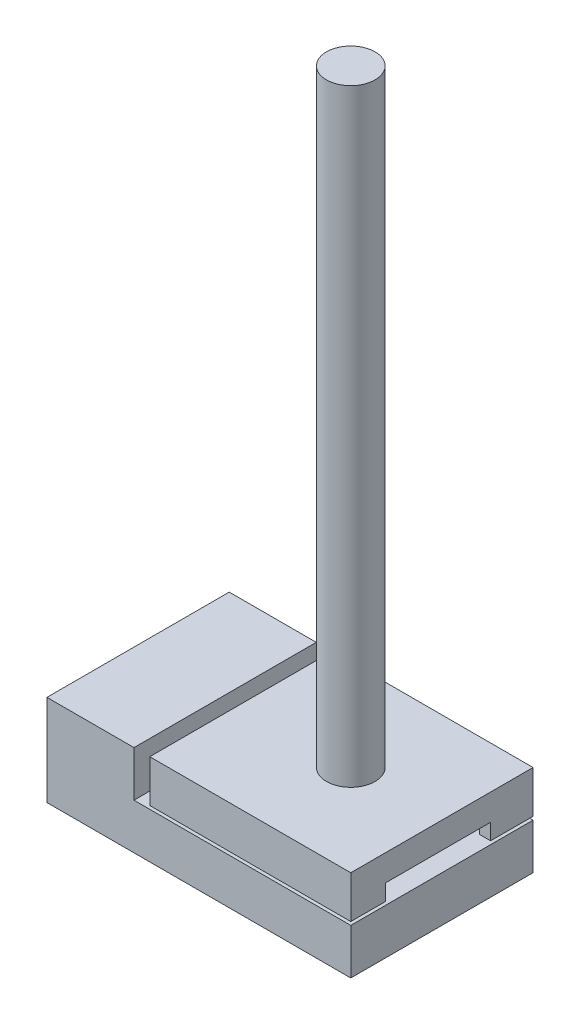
from build123d import *

# Parameters (mm, degrees)
SKETCH1_W           = 100
SKETCH1_H           = 60
BOSS_EXTRUDE1_DEPTH = 30
SKETCH2_R           = 8
BOSS_EXTRUDE2_DEPTH = 200
SKETCH3_W           = 66.159587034
SKETCH3_H           = 1.085635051
CUT_EXTRUDE1_DEPTH  = 200
SKETCH4_W           = 34.569733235
SKETCH4_H           = 5.298969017
CUT_EXTRUDE2_DEPTH  = 10
SKETCH5_W           = 2.542316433
SKETCH5_H           = 5.298969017
CUT_EXTRUDE3_DEPTH  = 4
BOSS_EXTRUDE3_DEPTH = 20


with BuildPart() as part:
    # Sketch1 → Boss-Extrude1 (new body)
    with BuildSketch(Plane(origin=(0, 0, 0), x_dir=(1, 0, 0), z_dir=(0, 1, 0))):
        Rectangle(SKETCH1_W, SKETCH1_H)
    extrude(amount=BOSS_EXTRUDE1_DEPTH)

    # Sketch2 → Boss-Extrude2 (add)
    with BuildSketch(Plane(origin=(0, 30, 0), x_dir=(1, 0, 0), z_dir=(0, 1, 0))):
        with Locations(Location((20, 0, 0), (0, 0, 270))):
            Circle(SKETCH2_R)
    extrude(amount=BOSS_EXTRUDE2_DEPTH)

    # Sketch3 → Cut-Extrude1 (cut)
    with BuildSketch(Plane.XY.offset(30)):
        Polygon((-16.159587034, 30), (-21.357128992, 30), (-21.357128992, 15), (-16.159587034, 15), (-16.159587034, 16.085635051), align=None)
        with Locations((16.920206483, 15.542817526)):
            Rectangle(SKETCH3_W, SKETCH3_H)
    extrude(amount=-CUT_EXTRUDE1_DEPTH, mode=Mode.SUBTRACT)


with BuildPart() as cut_extrude1_piece_1:
    # of the separate pieces the step leaves, piece 1, a body of its own (cut_extrude1_pieces)
    add(part.part.solids().sort_by_distance((-50, 0, -30))[0])

    # Sketch6 → Boss-Extrude3 (add)
    with BuildSketch(Plane.XZ):
        with BuildLine():
            Line((-50, -30), (-50, 30))
            ThreePointArc((-50, 30), (-55.848035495, 0), (-50, -30))
        make_face()
    extrude(amount=-BOSS_EXTRUDE3_DEPTH)


with BuildPart() as cut_extrude1_piece_2:
    # of the separate pieces the step leaves, piece 2, a body of its own (cut_extrude1_pieces)
    add(part.part.solids().sort_by_distance((-16.159587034, 30, -30))[0])

    # Sketch4 → Cut-Extrude2 (cut)
    with BuildSketch(Plane(origin=(50, 0, 0), x_dir=(0, 0, -1), z_dir=(1, 0, 0))):
        with Locations((-1.255625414, 18.735119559)):
            Rectangle(SKETCH4_W, SKETCH4_H)
    extrude(amount=-CUT_EXTRUDE2_DEPTH, mode=Mode.SUBTRACT)

    # Sketch5 → Cut-Extrude3 (cut)
    with BuildSketch(Plane.XY.offset(-16.029241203)):
        with Locations((45.077621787, 18.735119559)):
            Rectangle(SKETCH5_W, SKETCH5_H)
    extrude(amount=-CUT_EXTRUDE3_DEPTH, mode=Mode.SUBTRACT)


solid = Compound([cut_extrude1_piece_1.part, cut_extrude1_piece_2.part])
